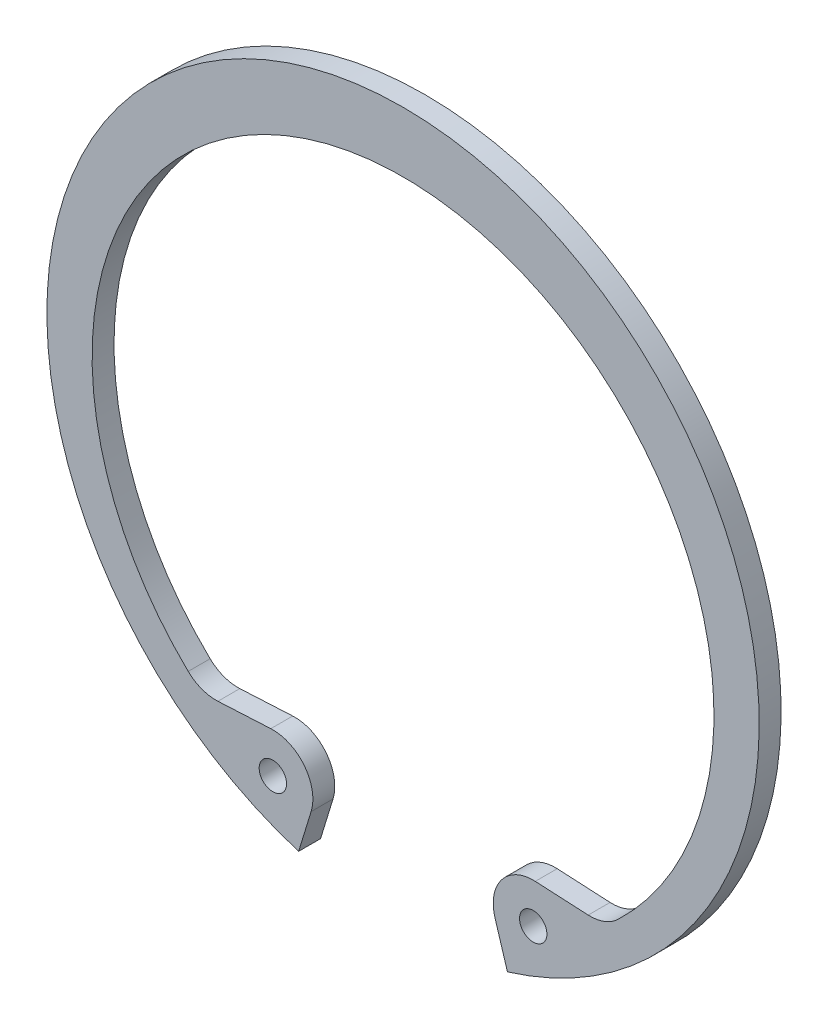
from build123d import *

# Parameters (mm, degrees)
ESQUISSE1_R          = 1.25
BASE_EXTRUSION_DEPTH = 2


with BuildPart() as part:
    # Esquisse1 → Base-Extrusion (new body)
    with BuildSketch(Plane.XY):
        with BuildLine():
            Line((8.38918788, -27.360948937), (9.527113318, -31.072240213))
            ThreePointArc((9.527113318, -31.072240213), (0, 32.5), (-9.527113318, -31.072240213))
            Line((-9.527113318, -31.072240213), (-8.38918788, -27.360948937))
            ThreePointArc((-8.38918788, -27.360948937), (-9.000790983, -24.046134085), (-12.066929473, -22.645830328))
            Line((-12.066929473, -22.645830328), (-16.894580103, -22.89493741))
            ThreePointArc((-16.894580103, -22.89493741), (-18.353408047, -22.671442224), (-19.604479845, -21.888531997))
            ThreePointArc((-19.604479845, -21.888531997), (0, 27), (19.604479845, -21.888531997))
            ThreePointArc((19.604479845, -21.888531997), (18.353408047, -22.671442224), (16.894580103, -22.89493741))
            Line((16.894580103, -22.89493741), (12.066929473, -22.645830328))
            ThreePointArc((12.066929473, -22.645830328), (9.000790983, -24.046134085), (8.38918788, -27.360948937))
        make_face()
        with Locations((11.878839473, -26.290980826)):
            Circle(ESQUISSE1_R, mode=Mode.SUBTRACT)
        with Locations(Location((-11.878839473, -26.290980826, 0), (0, 0, 180))):
            Circle(ESQUISSE1_R, mode=Mode.SUBTRACT)
    extrude(amount=BASE_EXTRUSION_DEPTH)


solid = part.part
